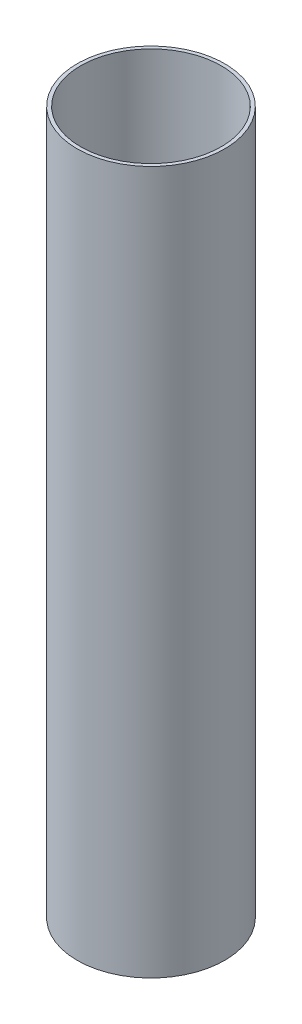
ISO-10303-21;
HEADER;
FILE_DESCRIPTION(('STEP AP214'),'2;1');
FILE_NAME('part.step','',(''),(''),'','','');
FILE_SCHEMA(('AUTOMOTIVE_DESIGN { 1 0 10303 214 1 1 1 1 }'));
ENDSEC;
DATA;
#1=APPLICATION_CONTEXT('core data for automotive mechanical design processes');
#2=APPLICATION_PROTOCOL_DEFINITION('international standard','automotive_design',2000,#1);
#3=PRODUCT_CONTEXT('',#1,'mechanical');
#4=PRODUCT('Part','Part','',(#3));
#5=PRODUCT_RELATED_PRODUCT_CATEGORY('part','',(#4));
#6=PRODUCT_DEFINITION_FORMATION('','',#4);
#7=PRODUCT_DEFINITION_CONTEXT('part definition',#1,'design');
#8=PRODUCT_DEFINITION('design','',#6,#7);
#9=PRODUCT_DEFINITION_SHAPE('','',#8);
#10=(LENGTH_UNIT() NAMED_UNIT(*) SI_UNIT(.MILLI.,.METRE.));
#11=(NAMED_UNIT(*) PLANE_ANGLE_UNIT() SI_UNIT($,.RADIAN.));
#12=(NAMED_UNIT(*) SI_UNIT($,.STERADIAN.) SOLID_ANGLE_UNIT());
#13=UNCERTAINTY_MEASURE_WITH_UNIT(LENGTH_MEASURE(1.E-05),#10,'distance_accuracy_value','');
#14=(GEOMETRIC_REPRESENTATION_CONTEXT(3) GLOBAL_UNCERTAINTY_ASSIGNED_CONTEXT((#13)) GLOBAL_UNIT_ASSIGNED_CONTEXT((#10,
#11,#12)) REPRESENTATION_CONTEXT('',''));
#15=CARTESIAN_POINT('',(0.,0.,0.));
#16=DIRECTION('',(0.,0.,1.));
#17=DIRECTION('',(1.,0.,0.));
#18=AXIS2_PLACEMENT_3D('',#15,#16,#17);
#19=CARTESIAN_POINT('',(0.,200.,0.));
#20=DIRECTION('',(0.,1.,0.));
#21=DIRECTION('',(0.,0.,1.));
#22=AXIS2_PLACEMENT_3D('',#19,#20,#21);
#23=PLANE('',#22);
#24=CARTESIAN_POINT('',(0.,200.,0.));
#25=DIRECTION('',(0.,1.,0.));
#26=DIRECTION('',(0.,0.,1.));
#27=AXIS2_PLACEMENT_3D('',#24,#25,#26);
#28=CIRCLE('',#27,21.);
#29=CARTESIAN_POINT('',(0.,200.,21.));
#30=VERTEX_POINT('',#29);
#31=EDGE_CURVE('E10',#30,#30,#28,.T.);
#32=ORIENTED_EDGE('',*,*,#31,.T.);
#33=EDGE_LOOP('',(#32));
#34=FACE_BOUND('',#33,.T.);
#35=CARTESIAN_POINT('',(0.,200.,0.));
#36=DIRECTION('',(0.,1.,0.));
#37=DIRECTION('',(0.,0.,1.));
#38=AXIS2_PLACEMENT_3D('',#35,#36,#37);
#39=CIRCLE('',#38,20.);
#40=CARTESIAN_POINT('',(0.,200.,20.));
#41=VERTEX_POINT('',#40);
#42=EDGE_CURVE('E54',#41,#41,#39,.T.);
#43=ORIENTED_EDGE('',*,*,#42,.F.);
#44=EDGE_LOOP('',(#43));
#45=FACE_BOUND('',#44,.T.);
#46=ADVANCED_FACE('F41',(#34,#45),#23,.T.);
#47=CARTESIAN_POINT('',(0.,0.,0.));
#48=DIRECTION('',(0.,1.,0.));
#49=DIRECTION('',(0.,0.,1.));
#50=AXIS2_PLACEMENT_3D('',#47,#48,#49);
#51=PLANE('',#50);
#52=CARTESIAN_POINT('',(0.,0.,0.));
#53=DIRECTION('',(0.,1.,0.));
#54=DIRECTION('',(0.,0.,1.));
#55=AXIS2_PLACEMENT_3D('',#52,#53,#54);
#56=CIRCLE('',#55,21.);
#57=CARTESIAN_POINT('',(0.,0.,21.));
#58=VERTEX_POINT('',#57);
#59=EDGE_CURVE('E45',#58,#58,#56,.T.);
#60=ORIENTED_EDGE('',*,*,#59,.F.);
#61=EDGE_LOOP('',(#60));
#62=FACE_BOUND('',#61,.T.);
#63=CARTESIAN_POINT('',(0.,0.,0.));
#64=DIRECTION('',(0.,1.,0.));
#65=DIRECTION('',(0.,0.,1.));
#66=AXIS2_PLACEMENT_3D('',#63,#64,#65);
#67=CIRCLE('',#66,20.);
#68=CARTESIAN_POINT('',(0.,0.,20.));
#69=VERTEX_POINT('',#68);
#70=EDGE_CURVE('E56',#69,#69,#67,.T.);
#71=ORIENTED_EDGE('',*,*,#70,.T.);
#72=EDGE_LOOP('',(#71));
#73=FACE_BOUND('',#72,.T.);
#74=ADVANCED_FACE('F68',(#62,#73),#51,.F.);
#75=CARTESIAN_POINT('',(0.,200.,0.));
#76=DIRECTION('',(0.,-1.,0.));
#77=DIRECTION('',(0.,0.,-1.));
#78=AXIS2_PLACEMENT_3D('',#75,#76,#77);
#79=CYLINDRICAL_SURFACE('',#78,21.);
#80=ORIENTED_EDGE('',*,*,#31,.F.);
#81=EDGE_LOOP('',(#80));
#82=FACE_BOUND('',#81,.T.);
#83=ORIENTED_EDGE('',*,*,#59,.T.);
#84=EDGE_LOOP('',(#83));
#85=FACE_BOUND('',#84,.T.);
#86=ADVANCED_FACE('F43',(#82,#85),#79,.T.);
#87=CARTESIAN_POINT('',(0.,200.,0.));
#88=DIRECTION('',(0.,-1.,0.));
#89=DIRECTION('',(0.,0.,-1.));
#90=AXIS2_PLACEMENT_3D('',#87,#88,#89);
#91=CYLINDRICAL_SURFACE('',#90,20.);
#92=ORIENTED_EDGE('',*,*,#42,.T.);
#93=EDGE_LOOP('',(#92));
#94=FACE_BOUND('',#93,.T.);
#95=ORIENTED_EDGE('',*,*,#70,.F.);
#96=EDGE_LOOP('',(#95));
#97=FACE_BOUND('',#96,.T.);
#98=ADVANCED_FACE('F64',(#94,#97),#91,.F.);
#99=CLOSED_SHELL('',(#46,#74,#86,#98));
#100=MANIFOLD_SOLID_BREP('B2',#99);
#101=ADVANCED_BREP_SHAPE_REPRESENTATION('',(#18,#100),#14);
#102=SHAPE_DEFINITION_REPRESENTATION(#9,#101);
ENDSEC;
END-ISO-10303-21;
